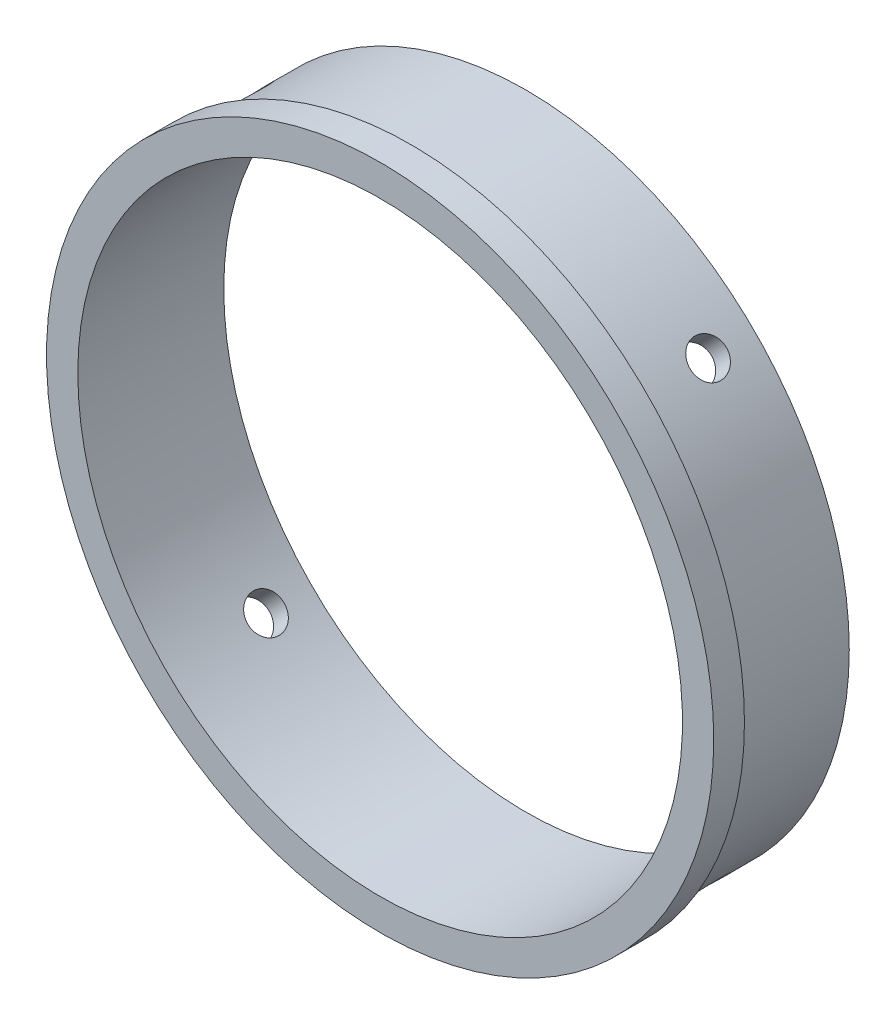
ISO-10303-21;
HEADER;
FILE_DESCRIPTION(('STEP AP214'),'2;1');
FILE_NAME('part.step','',(''),(''),'','','');
FILE_SCHEMA(('AUTOMOTIVE_DESIGN { 1 0 10303 214 1 1 1 1 }'));
ENDSEC;
DATA;
#1=APPLICATION_CONTEXT('core data for automotive mechanical design processes');
#2=APPLICATION_PROTOCOL_DEFINITION('international standard','automotive_design',2000,#1);
#3=PRODUCT_CONTEXT('',#1,'mechanical');
#4=PRODUCT('Part','Part','',(#3));
#5=PRODUCT_RELATED_PRODUCT_CATEGORY('part','',(#4));
#6=PRODUCT_DEFINITION_FORMATION('','',#4);
#7=PRODUCT_DEFINITION_CONTEXT('part definition',#1,'design');
#8=PRODUCT_DEFINITION('design','',#6,#7);
#9=PRODUCT_DEFINITION_SHAPE('','',#8);
#10=(LENGTH_UNIT() NAMED_UNIT(*) SI_UNIT(.MILLI.,.METRE.));
#11=(NAMED_UNIT(*) PLANE_ANGLE_UNIT() SI_UNIT($,.RADIAN.));
#12=(NAMED_UNIT(*) SI_UNIT($,.STERADIAN.) SOLID_ANGLE_UNIT());
#13=UNCERTAINTY_MEASURE_WITH_UNIT(LENGTH_MEASURE(1.E-05),#10,'distance_accuracy_value','');
#14=(GEOMETRIC_REPRESENTATION_CONTEXT(3) GLOBAL_UNCERTAINTY_ASSIGNED_CONTEXT((#13)) GLOBAL_UNIT_ASSIGNED_CONTEXT((#10,
#11,#12)) REPRESENTATION_CONTEXT('',''));
#15=CARTESIAN_POINT('',(0.,0.,0.));
#16=DIRECTION('',(0.,0.,1.));
#17=DIRECTION('',(1.,0.,0.));
#18=AXIS2_PLACEMENT_3D('',#15,#16,#17);
#19=CARTESIAN_POINT('',(0.,47.625,-37.35));
#20=DIRECTION('',(0.,0.,1.));
#21=DIRECTION('',(1.,0.,0.));
#22=AXIS2_PLACEMENT_3D('',#19,#20,#21);
#23=PLANE('',#22);
#24=CARTESIAN_POINT('',(0.,0.,-37.35));
#25=DIRECTION('',(0.,0.,-1.));
#26=DIRECTION('',(-1.,0.,0.));
#27=AXIS2_PLACEMENT_3D('',#24,#25,#26);
#28=CIRCLE('',#27,46.0375);
#29=CARTESIAN_POINT('',(-46.0375,0.,-37.35));
#30=VERTEX_POINT('',#29);
#31=EDGE_CURVE('E63',#30,#30,#28,.T.);
#32=ORIENTED_EDGE('',*,*,#31,.F.);
#33=EDGE_LOOP('',(#32));
#34=FACE_BOUND('',#33,.T.);
#35=CARTESIAN_POINT('',(0.,0.,-37.35));
#36=DIRECTION('',(0.,0.,1.));
#37=DIRECTION('',(1.,0.,0.));
#38=AXIS2_PLACEMENT_3D('',#35,#36,#37);
#39=CIRCLE('',#38,49.2125);
#40=CARTESIAN_POINT('',(49.2125,0.,-37.35));
#41=VERTEX_POINT('',#40);
#42=EDGE_CURVE('E47',#41,#41,#39,.T.);
#43=ORIENTED_EDGE('',*,*,#42,.F.);
#44=EDGE_LOOP('',(#43));
#45=FACE_BOUND('',#44,.T.);
#46=ADVANCED_FACE('F38',(#34,#45),#23,.F.);
#47=CARTESIAN_POINT('',(0.,0.,0.));
#48=DIRECTION('',(0.,0.,1.));
#49=DIRECTION('',(1.,0.,0.));
#50=AXIS2_PLACEMENT_3D('',#47,#48,#49);
#51=CYLINDRICAL_SURFACE('',#50,49.2125);
#52=CARTESIAN_POINT('',(36.7074316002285,-32.7785695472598,-30.2786400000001));
#53=CARTESIAN_POINT('',(36.707427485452,-32.7785751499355,-30.4345550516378));
#54=CARTESIAN_POINT('',(36.6986497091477,-32.7884122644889,-30.5905799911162));
#55=CARTESIAN_POINT('',(36.6637150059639,-32.827470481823,-30.8983237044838));
#56=CARTESIAN_POINT('',(36.6375377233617,-32.8567142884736,-31.0500372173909));
#57=CARTESIAN_POINT('',(36.5684269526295,-32.9336144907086,-31.3446556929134));
#58=CARTESIAN_POINT('',(36.5255021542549,-32.9812613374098,-31.4875651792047));
#59=CARTESIAN_POINT('',(36.4239296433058,-33.0934011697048,-31.7605674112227));
#60=CARTESIAN_POINT('',(36.3652855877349,-33.1578902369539,-31.8906631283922));
#61=CARTESIAN_POINT('',(36.233611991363,-33.3017267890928,-32.1345458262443));
#62=CARTESIAN_POINT('',(36.1605666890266,-33.3810905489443,-32.2483147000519));
#63=CARTESIAN_POINT('',(36.0019279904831,-33.5521223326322,-32.4561595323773));
#64=CARTESIAN_POINT('',(35.9163340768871,-33.6437908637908,-32.5502346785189));
#65=CARTESIAN_POINT('',(35.7347041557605,-33.8366458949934,-32.7160744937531));
#66=CARTESIAN_POINT('',(35.6386613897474,-33.9378385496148,-32.78782460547));
#67=CARTESIAN_POINT('',(35.4386857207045,-34.1466042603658,-32.9068843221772));
#68=CARTESIAN_POINT('',(35.3347528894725,-34.2541772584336,-32.9541941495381));
#69=CARTESIAN_POINT('',(35.1219128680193,-34.4723742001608,-33.0229812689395));
#70=CARTESIAN_POINT('',(35.0130111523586,-34.5829947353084,-33.04448631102));
#71=CARTESIAN_POINT('',(34.7931548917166,-34.8041784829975,-33.0611390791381));
#72=CARTESIAN_POINT('',(34.6822003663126,-34.9147416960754,-33.0562870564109));
#73=CARTESIAN_POINT('',(34.4615383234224,-35.1325567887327,-33.0203863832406));
#74=CARTESIAN_POINT('',(34.3518295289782,-35.2398122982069,-32.9893675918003));
#75=CARTESIAN_POINT('',(34.136743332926,-35.448206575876,-32.9020602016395));
#76=CARTESIAN_POINT('',(34.0313659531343,-35.5493453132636,-32.8457714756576));
#77=CARTESIAN_POINT('',(33.8280424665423,-35.7428794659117,-32.7094881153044));
#78=CARTESIAN_POINT('',(33.7301006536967,-35.8352698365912,-32.6294799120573));
#79=CARTESIAN_POINT('',(33.5447132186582,-36.008867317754,-32.4480386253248));
#80=CARTESIAN_POINT('',(33.4572676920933,-36.0900743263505,-32.3466053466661));
#81=CARTESIAN_POINT('',(33.2954893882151,-36.2393805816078,-32.1250245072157));
#82=CARTESIAN_POINT('',(33.2211750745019,-36.307461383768,-32.0048510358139));
#83=CARTESIAN_POINT('',(33.0881781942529,-36.4287077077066,-31.7492919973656));
#84=CARTESIAN_POINT('',(33.0294956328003,-36.4818732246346,-31.6139064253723));
#85=CARTESIAN_POINT('',(32.9296626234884,-36.572011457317,-31.3317501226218));
#86=CARTESIAN_POINT('',(32.8885129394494,-36.6089834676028,-31.1849788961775));
#87=CARTESIAN_POINT('',(32.8251036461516,-36.6658500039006,-30.8842249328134));
#88=CARTESIAN_POINT('',(32.802843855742,-36.6857446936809,-30.7302422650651));
#89=CARTESIAN_POINT('',(32.7779705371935,-36.707970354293,-30.4196639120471));
#90=CARTESIAN_POINT('',(32.7753299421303,-36.7103255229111,-30.2630721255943));
#91=CARTESIAN_POINT('',(32.7897113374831,-36.6974805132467,-29.9515206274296));
#92=CARTESIAN_POINT('',(32.8067332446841,-36.6822804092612,-29.7965609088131));
#93=CARTESIAN_POINT('',(32.8598570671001,-36.6346994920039,-29.4927744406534));
#94=CARTESIAN_POINT('',(32.8959465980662,-36.6023298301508,-29.3439437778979));
#95=CARTESIAN_POINT('',(32.9860119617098,-36.5211832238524,-29.0565195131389));
#96=CARTESIAN_POINT('',(33.0399879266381,-36.4724061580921,-28.9179259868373));
#97=CARTESIAN_POINT('',(33.164143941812,-36.3595480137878,-28.6547435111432));
#98=CARTESIAN_POINT('',(33.2343416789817,-36.2954502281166,-28.5301700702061));
#99=CARTESIAN_POINT('',(33.3886646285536,-36.1535363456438,-28.2987200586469));
#100=CARTESIAN_POINT('',(33.4727899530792,-36.075720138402,-28.191843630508));
#101=CARTESIAN_POINT('',(33.6524284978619,-35.9082063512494,-27.9986993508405));
#102=CARTESIAN_POINT('',(33.7479544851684,-35.8184954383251,-27.9124549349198));
#103=CARTESIAN_POINT('',(33.9473677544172,-35.6295554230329,-27.7631831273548));
#104=CARTESIAN_POINT('',(34.0512549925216,-35.5303263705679,-27.7001556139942));
#105=CARTESIAN_POINT('',(34.2641827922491,-35.3250304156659,-27.5991476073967));
#106=CARTESIAN_POINT('',(34.373220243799,-35.2189676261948,-27.5611522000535));
#107=CARTESIAN_POINT('',(34.5932802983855,-35.0028411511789,-27.511238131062));
#108=CARTESIAN_POINT('',(34.7043028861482,-34.8927774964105,-27.4993192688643));
#109=CARTESIAN_POINT('',(34.9249770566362,-34.6718974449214,-27.5018985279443));
#110=CARTESIAN_POINT('',(35.0346303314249,-34.5610823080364,-27.5163599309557));
#111=CARTESIAN_POINT('',(35.2496586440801,-34.341743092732,-27.5712131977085));
#112=CARTESIAN_POINT('',(35.3550336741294,-34.2332190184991,-27.6116051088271));
#113=CARTESIAN_POINT('',(35.5586512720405,-34.0216702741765,-27.7171648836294));
#114=CARTESIAN_POINT('',(35.6568938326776,-33.9186456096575,-27.782332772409));
#115=CARTESIAN_POINT('',(35.843668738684,-33.7212108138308,-27.9355889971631));
#116=CARTESIAN_POINT('',(35.9322013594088,-33.6268004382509,-28.0236766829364));
#117=CARTESIAN_POINT('',(36.0974166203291,-33.4493857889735,-28.220406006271));
#118=CARTESIAN_POINT('',(36.1740839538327,-33.366396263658,-28.3290737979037));
#119=CARTESIAN_POINT('',(36.3135487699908,-33.2145599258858,-28.5638508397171));
#120=CARTESIAN_POINT('',(36.3763428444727,-33.1457165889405,-28.6899643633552));
#121=CARTESIAN_POINT('',(36.4865710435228,-33.0243401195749,-28.956174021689));
#122=CARTESIAN_POINT('',(36.5339882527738,-32.9718249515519,-29.0962853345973));
#123=CARTESIAN_POINT('',(36.6121894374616,-32.8849690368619,-29.386300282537));
#124=CARTESIAN_POINT('',(36.6429929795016,-32.8506069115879,-29.5361921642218));
#125=CARTESIAN_POINT('',(36.6792031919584,-32.8101603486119,-29.7856136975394));
#126=CARTESIAN_POINT('',(36.6897772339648,-32.7983310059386,-29.8835293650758));
#127=CARTESIAN_POINT('',(36.7038927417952,-32.7825338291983,-30.0804952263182));
#128=CARTESIAN_POINT('',(36.7074342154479,-32.7785659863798,-30.1795454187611));
#129=CARTESIAN_POINT('',(36.7074316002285,-32.7785695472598,-30.2786400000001));
#130=B_SPLINE_CURVE_WITH_KNOTS('',3,(#52,#53,#54,#55,#56,#57,#58,#59,#60,#61,#62,#63,#64,#65,
#66,#67,#68,#69,#70,#71,#72,#73,#74,#75,#76,#77,#78,#79,#80,#81,#82,#83,#84,#85,#86,#87,#88,#89,
#90,#91,#92,#93,#94,#95,#96,#97,#98,#99,#100,#101,#102,#103,#104,#105,#106,#107,#108,#109,#110,
#111,#112,#113,#114,#115,#116,#117,#118,#119,#120,#121,#122,#123,#124,#125,#126,#127,#128,#129),
.UNSPECIFIED.,.T.,.F.,(4,2,2,2,2,2,2,2,2,2,2,2,2,2,2,2,2,2,2,2,2,2,2,2,2,2,2,2,2,2,2,2,2,2,2,2,
2,2,4),(0.,0.467383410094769,0.935314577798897,1.40300327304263,1.87058325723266,
2.33867785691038,2.80679176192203,3.27521027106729,3.74362451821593,4.21153458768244,
4.67944019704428,5.14681259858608,5.6141873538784,6.08182999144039,6.54947688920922,
7.01777619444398,7.48607565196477,7.95439550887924,8.42271087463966,8.89038002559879,
9.35804719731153,9.82541099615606,10.2927782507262,10.7606575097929,11.2285405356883,
11.6969525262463,12.1653620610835,12.6334922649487,13.1016188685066,13.5690943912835,
14.0365707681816,14.5040476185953,14.9715112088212,15.4395729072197,15.9077494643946,
16.3764393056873,16.8445759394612,17.1416301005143,17.4386839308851),.UNSPECIFIED.);
#131=CARTESIAN_POINT('',(36.7074316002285,-32.7785695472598,-30.2786400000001));
#132=VERTEX_POINT('',#131);
#133=EDGE_CURVE('E129',#132,#132,#130,.T.);
#134=ORIENTED_EDGE('',*,*,#133,.T.);
#135=EDGE_LOOP('',(#134));
#136=FACE_BOUND('',#135,.T.);
#137=CARTESIAN_POINT('',(-32.7785695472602,-36.7074316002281,-30.2786400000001));
#138=CARTESIAN_POINT('',(-32.7785751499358,-36.7074274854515,-30.4345550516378));
#139=CARTESIAN_POINT('',(-32.7884122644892,-36.6986497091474,-30.5905799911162));
#140=CARTESIAN_POINT('',(-32.8274704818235,-36.6637150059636,-30.8983237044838));
#141=CARTESIAN_POINT('',(-32.856714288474,-36.6375377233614,-31.0500372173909));
#142=CARTESIAN_POINT('',(-32.933614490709,-36.5684269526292,-31.3446556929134));
#143=CARTESIAN_POINT('',(-32.9812613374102,-36.5255021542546,-31.4875651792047));
#144=CARTESIAN_POINT('',(-33.0934011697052,-36.4239296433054,-31.7605674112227));
#145=CARTESIAN_POINT('',(-33.1578902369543,-36.3652855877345,-31.8906631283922));
#146=CARTESIAN_POINT('',(-33.3017267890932,-36.2336119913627,-32.1345458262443));
#147=CARTESIAN_POINT('',(-33.3810905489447,-36.1605666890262,-32.2483147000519));
#148=CARTESIAN_POINT('',(-33.5521223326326,-36.0019279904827,-32.4561595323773));
#149=CARTESIAN_POINT('',(-33.6437908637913,-35.9163340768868,-32.5502346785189));
#150=CARTESIAN_POINT('',(-33.8366458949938,-35.7347041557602,-32.7160744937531));
#151=CARTESIAN_POINT('',(-33.9378385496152,-35.6386613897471,-32.78782460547));
#152=CARTESIAN_POINT('',(-34.1466042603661,-35.4386857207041,-32.9068843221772));
#153=CARTESIAN_POINT('',(-34.2541772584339,-35.3347528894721,-32.9541941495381));
#154=CARTESIAN_POINT('',(-34.4723742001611,-35.1219128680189,-33.0229812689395));
#155=CARTESIAN_POINT('',(-34.5829947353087,-35.0130111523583,-33.04448631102));
#156=CARTESIAN_POINT('',(-34.8041784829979,-34.7931548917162,-33.0611390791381));
#157=CARTESIAN_POINT('',(-34.9147416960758,-34.6822003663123,-33.0562870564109));
#158=CARTESIAN_POINT('',(-35.1325567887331,-34.461538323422,-33.0203863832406));
#159=CARTESIAN_POINT('',(-35.2398122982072,-34.3518295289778,-32.9893675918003));
#160=CARTESIAN_POINT('',(-35.4482065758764,-34.1367433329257,-32.9020602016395));
#161=CARTESIAN_POINT('',(-35.549345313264,-34.031365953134,-32.8457714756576));
#162=CARTESIAN_POINT('',(-35.7428794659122,-33.828042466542,-32.7094881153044));
#163=CARTESIAN_POINT('',(-35.8352698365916,-33.7301006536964,-32.6294799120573));
#164=CARTESIAN_POINT('',(-36.0088673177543,-33.5447132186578,-32.4480386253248));
#165=CARTESIAN_POINT('',(-36.0900743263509,-33.4572676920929,-32.3466053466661));
#166=CARTESIAN_POINT('',(-36.2393805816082,-33.2954893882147,-32.1250245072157));
#167=CARTESIAN_POINT('',(-36.3074613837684,-33.2211750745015,-32.0048510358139));
#168=CARTESIAN_POINT('',(-36.4287077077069,-33.0881781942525,-31.7492919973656));
#169=CARTESIAN_POINT('',(-36.481873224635,-33.0294956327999,-31.6139064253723));
#170=CARTESIAN_POINT('',(-36.5720114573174,-32.929662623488,-31.3317501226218));
#171=CARTESIAN_POINT('',(-36.6089834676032,-32.8885129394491,-31.1849788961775));
#172=CARTESIAN_POINT('',(-36.6658500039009,-32.8251036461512,-30.8842249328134));
#173=CARTESIAN_POINT('',(-36.6857446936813,-32.8028438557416,-30.7302422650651));
#174=CARTESIAN_POINT('',(-36.7079703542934,-32.7779705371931,-30.4196639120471));
#175=CARTESIAN_POINT('',(-36.7103255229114,-32.7753299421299,-30.2630721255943));
#176=CARTESIAN_POINT('',(-36.6974805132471,-32.7897113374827,-29.9515206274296));
#177=CARTESIAN_POINT('',(-36.6822804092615,-32.8067332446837,-29.7965609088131));
#178=CARTESIAN_POINT('',(-36.6346994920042,-32.8598570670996,-29.4927744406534));
#179=CARTESIAN_POINT('',(-36.6023298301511,-32.8959465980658,-29.3439437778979));
#180=CARTESIAN_POINT('',(-36.5211832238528,-32.9860119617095,-29.0565195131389));
#181=CARTESIAN_POINT('',(-36.4724061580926,-33.0399879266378,-28.9179259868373));
#182=CARTESIAN_POINT('',(-36.3595480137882,-33.1641439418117,-28.6547435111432));
#183=CARTESIAN_POINT('',(-36.295450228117,-33.2343416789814,-28.5301700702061));
#184=CARTESIAN_POINT('',(-36.1535363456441,-33.3886646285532,-28.2987200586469));
#185=CARTESIAN_POINT('',(-36.0757201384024,-33.4727899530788,-28.191843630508));
#186=CARTESIAN_POINT('',(-35.9082063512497,-33.6524284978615,-27.9986993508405));
#187=CARTESIAN_POINT('',(-35.8184954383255,-33.747954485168,-27.9124549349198));
#188=CARTESIAN_POINT('',(-35.6295554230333,-33.9473677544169,-27.7631831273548));
#189=CARTESIAN_POINT('',(-35.5303263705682,-34.0512549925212,-27.7001556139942));
#190=CARTESIAN_POINT('',(-35.3250304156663,-34.2641827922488,-27.5991476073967));
#191=CARTESIAN_POINT('',(-35.2189676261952,-34.3732202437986,-27.5611522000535));
#192=CARTESIAN_POINT('',(-35.0028411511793,-34.5932802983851,-27.511238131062));
#193=CARTESIAN_POINT('',(-34.8927774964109,-34.7043028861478,-27.4993192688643));
#194=CARTESIAN_POINT('',(-34.6718974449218,-34.9249770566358,-27.5018985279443));
#195=CARTESIAN_POINT('',(-34.5610823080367,-35.0346303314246,-27.5163599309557));
#196=CARTESIAN_POINT('',(-34.3417430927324,-35.2496586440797,-27.5712131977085));
#197=CARTESIAN_POINT('',(-34.2332190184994,-35.355033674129,-27.6116051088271));
#198=CARTESIAN_POINT('',(-34.0216702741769,-35.5586512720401,-27.7171648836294));
#199=CARTESIAN_POINT('',(-33.9186456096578,-35.6568938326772,-27.782332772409));
#200=CARTESIAN_POINT('',(-33.7212108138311,-35.8436687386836,-27.9355889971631));
#201=CARTESIAN_POINT('',(-33.6268004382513,-35.9322013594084,-28.0236766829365));
#202=CARTESIAN_POINT('',(-33.4493857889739,-36.0974166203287,-28.220406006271));
#203=CARTESIAN_POINT('',(-33.3663962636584,-36.1740839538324,-28.3290737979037));
#204=CARTESIAN_POINT('',(-33.2145599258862,-36.3135487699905,-28.5638508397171));
#205=CARTESIAN_POINT('',(-33.1457165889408,-36.3763428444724,-28.6899643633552));
#206=CARTESIAN_POINT('',(-33.0243401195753,-36.4865710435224,-28.956174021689));
#207=CARTESIAN_POINT('',(-32.9718249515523,-36.5339882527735,-29.0962853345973));
#208=CARTESIAN_POINT('',(-32.8849690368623,-36.6121894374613,-29.386300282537));
#209=CARTESIAN_POINT('',(-32.8506069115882,-36.6429929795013,-29.5361921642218));
#210=CARTESIAN_POINT('',(-32.8101603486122,-36.679203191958,-29.7856136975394));
#211=CARTESIAN_POINT('',(-32.798331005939,-36.6897772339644,-29.8835293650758));
#212=CARTESIAN_POINT('',(-32.7825338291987,-36.7038927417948,-30.0804952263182));
#213=CARTESIAN_POINT('',(-32.7785659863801,-36.7074342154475,-30.1795454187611));
#214=CARTESIAN_POINT('',(-32.7785695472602,-36.7074316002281,-30.2786400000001));
#215=B_SPLINE_CURVE_WITH_KNOTS('',3,(#137,#138,#139,#140,#141,#142,#143,#144,#145,#146,#147,
#148,#149,#150,#151,#152,#153,#154,#155,#156,#157,#158,#159,#160,#161,#162,#163,#164,#165,#166,
#167,#168,#169,#170,#171,#172,#173,#174,#175,#176,#177,#178,#179,#180,#181,#182,#183,#184,#185,
#186,#187,#188,#189,#190,#191,#192,#193,#194,#195,#196,#197,#198,#199,#200,#201,#202,#203,#204,
#205,#206,#207,#208,#209,#210,#211,#212,#213,#214),.UNSPECIFIED.,.T.,.F.,(4,2,2,2,2,2,2,2,2,2,2,
2,2,2,2,2,2,2,2,2,2,2,2,2,2,2,2,2,2,2,2,2,2,2,2,2,2,2,4),(0.,0.46738341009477,0.935314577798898,
1.40300327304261,1.87058325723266,2.33867785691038,2.80679176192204,3.27521027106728,
3.74362451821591,4.21153458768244,4.67944019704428,5.14681259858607,5.6141873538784,
6.08182999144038,6.54947688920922,7.01777619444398,7.48607565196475,7.95439550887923,
8.42271087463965,8.89038002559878,9.35804719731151,9.82541099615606,10.2927782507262,
10.7606575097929,11.2285405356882,11.6969525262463,12.1653620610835,12.6334922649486,
13.1016188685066,13.5690943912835,14.0365707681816,14.5040476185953,14.9715112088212,
15.4395729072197,15.9077494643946,16.3764393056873,16.8445759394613,17.1416301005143,
17.4386839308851),.UNSPECIFIED.);
#216=CARTESIAN_POINT('',(-32.7785695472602,-36.7074316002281,-30.2786400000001));
#217=VERTEX_POINT('',#216);
#218=EDGE_CURVE('E106',#217,#217,#215,.T.);
#219=ORIENTED_EDGE('',*,*,#218,.T.);
#220=EDGE_LOOP('',(#219));
#221=FACE_BOUND('',#220,.T.);
#222=CARTESIAN_POINT('',(-36.7074316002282,32.7785695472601,-30.2786400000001));
#223=CARTESIAN_POINT('',(-36.7074274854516,32.7785751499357,-30.4345550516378));
#224=CARTESIAN_POINT('',(-36.6986497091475,32.7884122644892,-30.5905799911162));
#225=CARTESIAN_POINT('',(-36.6637150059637,32.8274704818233,-30.8983237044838));
#226=CARTESIAN_POINT('',(-36.6375377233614,32.8567142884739,-31.0500372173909));
#227=CARTESIAN_POINT('',(-36.5684269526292,32.9336144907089,-31.3446556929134));
#228=CARTESIAN_POINT('',(-36.5255021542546,32.9812613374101,-31.4875651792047));
#229=CARTESIAN_POINT('',(-36.4239296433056,33.0934011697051,-31.7605674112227));
#230=CARTESIAN_POINT('',(-36.3652855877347,33.1578902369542,-31.8906631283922));
#231=CARTESIAN_POINT('',(-36.2336119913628,33.301726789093,-32.1345458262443));
#232=CARTESIAN_POINT('',(-36.1605666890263,33.3810905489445,-32.2483147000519));
#233=CARTESIAN_POINT('',(-36.0019279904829,33.5521223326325,-32.4561595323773));
#234=CARTESIAN_POINT('',(-35.916334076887,33.6437908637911,-32.5502346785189));
#235=CARTESIAN_POINT('',(-35.7347041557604,33.8366458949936,-32.7160744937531));
#236=CARTESIAN_POINT('',(-35.6386613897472,33.937838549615,-32.78782460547));
#237=CARTESIAN_POINT('',(-35.4386857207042,34.146604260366,-32.9068843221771));
#238=CARTESIAN_POINT('',(-35.3347528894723,34.2541772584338,-32.9541941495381));
#239=CARTESIAN_POINT('',(-35.1219128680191,34.472374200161,-33.0229812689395));
#240=CARTESIAN_POINT('',(-35.0130111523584,34.5829947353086,-33.04448631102));
#241=CARTESIAN_POINT('',(-34.7931548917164,34.8041784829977,-33.0611390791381));
#242=CARTESIAN_POINT('',(-34.6822003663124,34.9147416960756,-33.0562870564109));
#243=CARTESIAN_POINT('',(-34.4615383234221,35.1325567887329,-33.0203863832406));
#244=CARTESIAN_POINT('',(-34.351829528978,35.239812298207,-32.9893675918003));
#245=CARTESIAN_POINT('',(-34.1367433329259,35.4482065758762,-32.9020602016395));
#246=CARTESIAN_POINT('',(-34.0313659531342,35.5493453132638,-32.8457714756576));
#247=CARTESIAN_POINT('',(-33.8280424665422,35.742879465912,-32.7094881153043));
#248=CARTESIAN_POINT('',(-33.7301006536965,35.8352698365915,-32.6294799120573));
#249=CARTESIAN_POINT('',(-33.5447132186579,36.0088673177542,-32.4480386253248));
#250=CARTESIAN_POINT('',(-33.4572676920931,36.0900743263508,-32.3466053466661));
#251=CARTESIAN_POINT('',(-33.2954893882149,36.2393805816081,-32.1250245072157));
#252=CARTESIAN_POINT('',(-33.2211750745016,36.3074613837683,-32.0048510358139));
#253=CARTESIAN_POINT('',(-33.0881781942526,36.4287077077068,-31.7492919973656));
#254=CARTESIAN_POINT('',(-33.0294956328,36.4818732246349,-31.6139064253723));
#255=CARTESIAN_POINT('',(-32.9296626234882,36.5720114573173,-31.3317501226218));
#256=CARTESIAN_POINT('',(-32.8885129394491,36.6089834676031,-31.1849788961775));
#257=CARTESIAN_POINT('',(-32.8251036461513,36.6658500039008,-30.8842249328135));
#258=CARTESIAN_POINT('',(-32.8028438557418,36.6857446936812,-30.7302422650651));
#259=CARTESIAN_POINT('',(-32.7779705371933,36.7079703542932,-30.4196639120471));
#260=CARTESIAN_POINT('',(-32.77532994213,36.7103255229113,-30.2630721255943));
#261=CARTESIAN_POINT('',(-32.7897113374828,36.697480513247,-29.9515206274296));
#262=CARTESIAN_POINT('',(-32.8067332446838,36.6822804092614,-29.7965609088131));
#263=CARTESIAN_POINT('',(-32.8598570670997,36.6346994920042,-29.4927744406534));
#264=CARTESIAN_POINT('',(-32.8959465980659,36.602329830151,-29.3439437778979));
#265=CARTESIAN_POINT('',(-32.9860119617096,36.5211832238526,-29.0565195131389));
#266=CARTESIAN_POINT('',(-33.039987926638,36.4724061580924,-28.9179259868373));
#267=CARTESIAN_POINT('',(-33.1641439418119,36.359548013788,-28.6547435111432));
#268=CARTESIAN_POINT('',(-33.2343416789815,36.2954502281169,-28.530170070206));
#269=CARTESIAN_POINT('',(-33.3886646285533,36.153536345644,-28.2987200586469));
#270=CARTESIAN_POINT('',(-33.472789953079,36.0757201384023,-28.191843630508));
#271=CARTESIAN_POINT('',(-33.6524284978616,35.9082063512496,-27.9986993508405));
#272=CARTESIAN_POINT('',(-33.7479544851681,35.8184954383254,-27.9124549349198));
#273=CARTESIAN_POINT('',(-33.947367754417,35.6295554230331,-27.7631831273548));
#274=CARTESIAN_POINT('',(-34.0512549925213,35.5303263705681,-27.7001556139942));
#275=CARTESIAN_POINT('',(-34.2641827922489,35.3250304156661,-27.5991476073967));
#276=CARTESIAN_POINT('',(-34.3732202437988,35.2189676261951,-27.5611522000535));
#277=CARTESIAN_POINT('',(-34.5932802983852,35.0028411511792,-27.511238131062));
#278=CARTESIAN_POINT('',(-34.7043028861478,34.8927774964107,-27.4993192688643));
#279=CARTESIAN_POINT('',(-34.9249770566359,34.6718974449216,-27.5018985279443));
#280=CARTESIAN_POINT('',(-35.0346303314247,34.5610823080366,-27.5163599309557));
#281=CARTESIAN_POINT('',(-35.2496586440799,34.3417430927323,-27.5712131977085));
#282=CARTESIAN_POINT('',(-35.3550336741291,34.2332190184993,-27.6116051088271));
#283=CARTESIAN_POINT('',(-35.5586512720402,34.0216702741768,-27.7171648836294));
#284=CARTESIAN_POINT('',(-35.6568938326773,33.9186456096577,-27.782332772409));
#285=CARTESIAN_POINT('',(-35.8436687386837,33.721210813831,-27.9355889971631));
#286=CARTESIAN_POINT('',(-35.9322013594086,33.6268004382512,-28.0236766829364));
#287=CARTESIAN_POINT('',(-36.0974166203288,33.4493857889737,-28.220406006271));
#288=CARTESIAN_POINT('',(-36.1740839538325,33.3663962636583,-28.3290737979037));
#289=CARTESIAN_POINT('',(-36.3135487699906,33.214559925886,-28.5638508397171));
#290=CARTESIAN_POINT('',(-36.3763428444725,33.1457165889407,-28.6899643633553));
#291=CARTESIAN_POINT('',(-36.4865710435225,33.0243401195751,-28.956174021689));
#292=CARTESIAN_POINT('',(-36.5339882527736,32.9718249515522,-29.0962853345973));
#293=CARTESIAN_POINT('',(-36.6121894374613,32.8849690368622,-29.386300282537));
#294=CARTESIAN_POINT('',(-36.6429929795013,32.8506069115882,-29.5361921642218));
#295=CARTESIAN_POINT('',(-36.6792031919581,32.8101603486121,-29.7856136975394));
#296=CARTESIAN_POINT('',(-36.6897772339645,32.7983310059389,-29.8835293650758));
#297=CARTESIAN_POINT('',(-36.7038927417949,32.7825338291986,-30.0804952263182));
#298=CARTESIAN_POINT('',(-36.7074342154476,32.77856598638,-30.1795454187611));
#299=CARTESIAN_POINT('',(-36.7074316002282,32.7785695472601,-30.2786400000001));
#300=B_SPLINE_CURVE_WITH_KNOTS('',3,(#222,#223,#224,#225,#226,#227,#228,#229,#230,#231,#232,
#233,#234,#235,#236,#237,#238,#239,#240,#241,#242,#243,#244,#245,#246,#247,#248,#249,#250,#251,
#252,#253,#254,#255,#256,#257,#258,#259,#260,#261,#262,#263,#264,#265,#266,#267,#268,#269,#270,
#271,#272,#273,#274,#275,#276,#277,#278,#279,#280,#281,#282,#283,#284,#285,#286,#287,#288,#289,
#290,#291,#292,#293,#294,#295,#296,#297,#298,#299),.UNSPECIFIED.,.T.,.F.,(4,2,2,2,2,2,2,2,2,2,2,
2,2,2,2,2,2,2,2,2,2,2,2,2,2,2,2,2,2,2,2,2,2,2,2,2,2,2,4),(0.,0.467383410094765,
0.935314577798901,1.40300327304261,1.87058325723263,2.33867785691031,2.80679176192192,
3.27521027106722,3.74362451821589,4.2115345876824,4.67944019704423,5.14681259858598,
5.61418735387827,6.08182999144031,6.5494768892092,7.01777619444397,7.48607565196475,
7.95439550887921,8.42271087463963,8.89038002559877,9.3580471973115,9.82541099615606,
10.2927782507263,10.7606575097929,11.2285405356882,11.6969525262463,12.1653620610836,
12.6334922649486,13.1016188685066,13.5690943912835,14.0365707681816,14.5040476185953,
14.9715112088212,15.4395729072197,15.9077494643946,16.3764393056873,16.8445759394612,
17.1416301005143,17.4386839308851),.UNSPECIFIED.);
#301=CARTESIAN_POINT('',(-36.7074316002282,32.7785695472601,-30.2786400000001));
#302=VERTEX_POINT('',#301);
#303=EDGE_CURVE('E95',#302,#302,#300,.T.);
#304=ORIENTED_EDGE('',*,*,#303,.T.);
#305=EDGE_LOOP('',(#304));
#306=FACE_BOUND('',#305,.T.);
#307=CARTESIAN_POINT('',(32.7785695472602,36.7074316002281,-30.2786400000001));
#308=CARTESIAN_POINT('',(32.7785751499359,36.7074274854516,-30.4345550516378));
#309=CARTESIAN_POINT('',(32.7884122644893,36.6986497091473,-30.5905799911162));
#310=CARTESIAN_POINT('',(32.8274704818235,36.6637150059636,-30.8983237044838));
#311=CARTESIAN_POINT('',(32.856714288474,36.6375377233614,-31.0500372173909));
#312=CARTESIAN_POINT('',(32.933614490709,36.5684269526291,-31.3446556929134));
#313=CARTESIAN_POINT('',(32.9812613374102,36.5255021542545,-31.4875651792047));
#314=CARTESIAN_POINT('',(33.0934011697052,36.4239296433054,-31.7605674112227));
#315=CARTESIAN_POINT('',(33.1578902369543,36.3652855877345,-31.8906631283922));
#316=CARTESIAN_POINT('',(33.3017267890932,36.2336119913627,-32.1345458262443));
#317=CARTESIAN_POINT('',(33.3810905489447,36.1605666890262,-32.2483147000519));
#318=CARTESIAN_POINT('',(33.5521223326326,36.0019279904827,-32.4561595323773));
#319=CARTESIAN_POINT('',(33.6437908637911,35.9163340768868,-32.5502346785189));
#320=CARTESIAN_POINT('',(33.8366458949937,35.7347041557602,-32.7160744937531));
#321=CARTESIAN_POINT('',(33.9378385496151,35.6386613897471,-32.78782460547));
#322=CARTESIAN_POINT('',(34.1466042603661,35.4386857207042,-32.9068843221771));
#323=CARTESIAN_POINT('',(34.2541772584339,35.3347528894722,-32.9541941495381));
#324=CARTESIAN_POINT('',(34.4723742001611,35.121912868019,-33.0229812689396));
#325=CARTESIAN_POINT('',(34.5829947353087,35.0130111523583,-33.04448631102));
#326=CARTESIAN_POINT('',(34.8041784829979,34.7931548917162,-33.061139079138));
#327=CARTESIAN_POINT('',(34.9147416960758,34.6822003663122,-33.0562870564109));
#328=CARTESIAN_POINT('',(35.1325567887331,34.461538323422,-33.0203863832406));
#329=CARTESIAN_POINT('',(35.2398122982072,34.3518295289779,-32.9893675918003));
#330=CARTESIAN_POINT('',(35.4482065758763,34.1367433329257,-32.9020602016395));
#331=CARTESIAN_POINT('',(35.5493453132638,34.031365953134,-32.8457714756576));
#332=CARTESIAN_POINT('',(35.742879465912,33.828042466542,-32.7094881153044));
#333=CARTESIAN_POINT('',(35.8352698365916,33.7301006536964,-32.6294799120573));
#334=CARTESIAN_POINT('',(36.0088673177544,33.5447132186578,-32.4480386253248));
#335=CARTESIAN_POINT('',(36.0900743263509,33.4572676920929,-32.3466053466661));
#336=CARTESIAN_POINT('',(36.2393805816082,33.2954893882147,-32.1250245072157));
#337=CARTESIAN_POINT('',(36.3074613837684,33.2211750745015,-32.0048510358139));
#338=CARTESIAN_POINT('',(36.4287077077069,33.0881781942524,-31.7492919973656));
#339=CARTESIAN_POINT('',(36.4818732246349,33.0294956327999,-31.6139064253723));
#340=CARTESIAN_POINT('',(36.5720114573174,32.929662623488,-31.3317501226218));
#341=CARTESIAN_POINT('',(36.6089834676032,32.888512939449,-31.1849788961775));
#342=CARTESIAN_POINT('',(36.6658500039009,32.8251036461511,-30.8842249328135));
#343=CARTESIAN_POINT('',(36.6857446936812,32.8028438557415,-30.7302422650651));
#344=CARTESIAN_POINT('',(36.7079703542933,32.7779705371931,-30.4196639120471));
#345=CARTESIAN_POINT('',(36.7103255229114,32.7753299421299,-30.2630721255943));
#346=CARTESIAN_POINT('',(36.6974805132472,32.7897113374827,-29.9515206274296));
#347=CARTESIAN_POINT('',(36.6822804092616,32.8067332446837,-29.7965609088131));
#348=CARTESIAN_POINT('',(36.6346994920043,32.8598570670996,-29.4927744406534));
#349=CARTESIAN_POINT('',(36.6023298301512,32.8959465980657,-29.3439437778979));
#350=CARTESIAN_POINT('',(36.5211832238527,32.9860119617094,-29.0565195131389));
#351=CARTESIAN_POINT('',(36.4724061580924,33.0399879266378,-28.9179259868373));
#352=CARTESIAN_POINT('',(36.359548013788,33.1641439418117,-28.6547435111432));
#353=CARTESIAN_POINT('',(36.295450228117,33.2343416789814,-28.530170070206));
#354=CARTESIAN_POINT('',(36.1535363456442,33.3886646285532,-28.2987200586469));
#355=CARTESIAN_POINT('',(36.0757201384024,33.4727899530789,-28.191843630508));
#356=CARTESIAN_POINT('',(35.9082063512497,33.6524284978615,-27.9986993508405));
#357=CARTESIAN_POINT('',(35.8184954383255,33.747954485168,-27.9124549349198));
#358=CARTESIAN_POINT('',(35.6295554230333,33.9473677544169,-27.7631831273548));
#359=CARTESIAN_POINT('',(35.5303263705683,34.0512549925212,-27.7001556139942));
#360=CARTESIAN_POINT('',(35.3250304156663,34.2641827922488,-27.5991476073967));
#361=CARTESIAN_POINT('',(35.2189676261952,34.3732202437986,-27.5611522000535));
#362=CARTESIAN_POINT('',(35.0028411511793,34.5932802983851,-27.511238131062));
#363=CARTESIAN_POINT('',(34.892777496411,34.7043028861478,-27.4993192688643));
#364=CARTESIAN_POINT('',(34.6718974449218,34.9249770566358,-27.5018985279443));
#365=CARTESIAN_POINT('',(34.5610823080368,35.0346303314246,-27.5163599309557));
#366=CARTESIAN_POINT('',(34.3417430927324,35.2496586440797,-27.5712131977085));
#367=CARTESIAN_POINT('',(34.2332190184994,35.3550336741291,-27.6116051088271));
#368=CARTESIAN_POINT('',(34.0216702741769,35.5586512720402,-27.7171648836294));
#369=CARTESIAN_POINT('',(33.9186456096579,35.6568938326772,-27.782332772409));
#370=CARTESIAN_POINT('',(33.7212108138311,35.8436687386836,-27.9355889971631));
#371=CARTESIAN_POINT('',(33.6268004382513,35.9322013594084,-28.0236766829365));
#372=CARTESIAN_POINT('',(33.4493857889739,36.0974166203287,-28.220406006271));
#373=CARTESIAN_POINT('',(33.3663962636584,36.1740839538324,-28.3290737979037));
#374=CARTESIAN_POINT('',(33.2145599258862,36.3135487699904,-28.5638508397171));
#375=CARTESIAN_POINT('',(33.1457165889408,36.3763428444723,-28.6899643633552));
#376=CARTESIAN_POINT('',(33.0243401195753,36.4865710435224,-28.956174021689));
#377=CARTESIAN_POINT('',(32.9718249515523,36.5339882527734,-29.0962853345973));
#378=CARTESIAN_POINT('',(32.8849690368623,36.6121894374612,-29.386300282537));
#379=CARTESIAN_POINT('',(32.8506069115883,36.6429929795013,-29.5361921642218));
#380=CARTESIAN_POINT('',(32.8101603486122,36.679203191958,-29.7856136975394));
#381=CARTESIAN_POINT('',(32.798331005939,36.6897772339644,-29.8835293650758));
#382=CARTESIAN_POINT('',(32.7825338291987,36.7038927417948,-30.0804952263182));
#383=CARTESIAN_POINT('',(32.7785659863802,36.7074342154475,-30.1795454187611));
#384=CARTESIAN_POINT('',(32.7785695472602,36.7074316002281,-30.2786400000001));
#385=B_SPLINE_CURVE_WITH_KNOTS('',3,(#307,#308,#309,#310,#311,#312,#313,#314,#315,#316,#317,
#318,#319,#320,#321,#322,#323,#324,#325,#326,#327,#328,#329,#330,#331,#332,#333,#334,#335,#336,
#337,#338,#339,#340,#341,#342,#343,#344,#345,#346,#347,#348,#349,#350,#351,#352,#353,#354,#355,
#356,#357,#358,#359,#360,#361,#362,#363,#364,#365,#366,#367,#368,#369,#370,#371,#372,#373,#374,
#375,#376,#377,#378,#379,#380,#381,#382,#383,#384),.UNSPECIFIED.,.T.,.F.,(4,2,2,2,2,2,2,2,2,2,2,
2,2,2,2,2,2,2,2,2,2,2,2,2,2,2,2,2,2,2,2,2,2,2,2,2,2,2,4),(0.,0.467383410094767,
0.935314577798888,1.4030032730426,1.87058325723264,2.33867785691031,2.80679176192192,
3.27521027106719,3.74362451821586,4.2115345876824,4.67944019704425,5.146812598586,
5.61418735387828,6.08182999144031,6.54947688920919,7.01777619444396,7.48607565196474,
7.95439550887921,8.42271087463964,8.89038002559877,9.3580471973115,9.82541099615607,
10.2927782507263,10.7606575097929,11.2285405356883,11.6969525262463,12.1653620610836,
12.6334922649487,13.1016188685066,13.5690943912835,14.0365707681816,14.5040476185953,
14.9715112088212,15.4395729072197,15.9077494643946,16.3764393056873,16.8445759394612,
17.1416301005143,17.4386839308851),.UNSPECIFIED.);
#386=CARTESIAN_POINT('',(32.7785695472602,36.7074316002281,-30.2786400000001));
#387=VERTEX_POINT('',#386);
#388=EDGE_CURVE('E10',#387,#387,#385,.T.);
#389=ORIENTED_EDGE('',*,*,#388,.T.);
#390=EDGE_LOOP('',(#389));
#391=FACE_BOUND('',#390,.T.);
#392=CARTESIAN_POINT('',(0.,0.,-19.80114));
#393=DIRECTION('',(0.,0.,1.));
#394=DIRECTION('',(1.,0.,0.));
#395=AXIS2_PLACEMENT_3D('',#392,#393,#394);
#396=CIRCLE('',#395,49.2125);
#397=CARTESIAN_POINT('',(49.2125,0.,-19.80114));
#398=VERTEX_POINT('',#397);
#399=EDGE_CURVE('E51',#398,#398,#396,.T.);
#400=ORIENTED_EDGE('',*,*,#399,.F.);
#401=EDGE_LOOP('',(#400));
#402=FACE_BOUND('',#401,.T.);
#403=ORIENTED_EDGE('',*,*,#42,.T.);
#404=EDGE_LOOP('',(#403));
#405=FACE_BOUND('',#404,.T.);
#406=ADVANCED_FACE('F141',(#136,#221,#306,#391,#402,#405),#51,.T.);
#407=CARTESIAN_POINT('',(0.,49.2125,-19.80114));
#408=DIRECTION('',(0.,0.,1.));
#409=DIRECTION('',(1.,0.,0.));
#410=AXIS2_PLACEMENT_3D('',#407,#408,#409);
#411=PLANE('',#410);
#412=CARTESIAN_POINT('',(0.,0.,-19.80114));
#413=DIRECTION('',(0.,0.,1.));
#414=DIRECTION('',(1.,0.,0.));
#415=AXIS2_PLACEMENT_3D('',#412,#413,#414);
#416=CIRCLE('',#415,50.8);
#417=CARTESIAN_POINT('',(50.8,0.,-19.80114));
#418=VERTEX_POINT('',#417);
#419=EDGE_CURVE('E55',#418,#418,#416,.T.);
#420=ORIENTED_EDGE('',*,*,#419,.F.);
#421=EDGE_LOOP('',(#420));
#422=FACE_BOUND('',#421,.T.);
#423=ORIENTED_EDGE('',*,*,#399,.T.);
#424=EDGE_LOOP('',(#423));
#425=FACE_BOUND('',#424,.T.);
#426=ADVANCED_FACE('F146',(#422,#425),#411,.F.);
#427=CARTESIAN_POINT('',(0.,0.,0.));
#428=DIRECTION('',(0.,0.,1.));
#429=DIRECTION('',(1.,0.,0.));
#430=AXIS2_PLACEMENT_3D('',#427,#428,#429);
#431=CYLINDRICAL_SURFACE('',#430,50.8);
#432=CARTESIAN_POINT('',(0.,0.,-15.125));
#433=DIRECTION('',(0.,0.,1.));
#434=DIRECTION('',(1.,0.,0.));
#435=AXIS2_PLACEMENT_3D('',#432,#433,#434);
#436=CIRCLE('',#435,50.8);
#437=CARTESIAN_POINT('',(50.8,0.,-15.125));
#438=VERTEX_POINT('',#437);
#439=EDGE_CURVE('E60',#438,#438,#436,.T.);
#440=ORIENTED_EDGE('',*,*,#439,.F.);
#441=EDGE_LOOP('',(#440));
#442=FACE_BOUND('',#441,.T.);
#443=ORIENTED_EDGE('',*,*,#419,.T.);
#444=EDGE_LOOP('',(#443));
#445=FACE_BOUND('',#444,.T.);
#446=ADVANCED_FACE('F157',(#442,#445),#431,.T.);
#447=CARTESIAN_POINT('',(0.,50.8,-15.125));
#448=DIRECTION('',(0.,0.,-1.));
#449=DIRECTION('',(-1.,0.,0.));
#450=AXIS2_PLACEMENT_3D('',#447,#448,#449);
#451=PLANE('',#450);
#452=ORIENTED_EDGE('',*,*,#439,.T.);
#453=EDGE_LOOP('',(#452));
#454=FACE_BOUND('',#453,.T.);
#455=CARTESIAN_POINT('',(0.,0.,-15.125));
#456=DIRECTION('',(0.,0.,-1.));
#457=DIRECTION('',(-1.,0.,0.));
#458=AXIS2_PLACEMENT_3D('',#455,#456,#457);
#459=CIRCLE('',#458,46.0375);
#460=CARTESIAN_POINT('',(-46.0375,0.,-15.125));
#461=VERTEX_POINT('',#460);
#462=EDGE_CURVE('E64',#461,#461,#459,.F.);
#463=ORIENTED_EDGE('',*,*,#462,.F.);
#464=EDGE_LOOP('',(#463));
#465=FACE_BOUND('',#464,.T.);
#466=ADVANCED_FACE('F152',(#454,#465),#451,.F.);
#467=CARTESIAN_POINT('',(0.,0.,115.088713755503));
#468=DIRECTION('',(0.,0.,-1.));
#469=DIRECTION('',(-1.,0.,0.));
#470=AXIS2_PLACEMENT_3D('',#467,#468,#469);
#471=CYLINDRICAL_SURFACE('',#470,46.0375);
#472=CARTESIAN_POINT('',(34.4585337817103,-30.5296717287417,-30.2786400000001));
#473=CARTESIAN_POINT('',(34.4585297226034,-30.529677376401,-30.1227439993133));
#474=CARTESIAN_POINT('',(34.4497907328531,-30.5395487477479,-29.9667385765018));
#475=CARTESIAN_POINT('',(34.4150076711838,-30.5787395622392,-29.6590346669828));
#476=CARTESIAN_POINT('',(34.3889434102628,-30.6080816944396,-29.5073414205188));
#477=CARTESIAN_POINT('',(34.3201216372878,-30.6852295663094,-29.2127635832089));
#478=CARTESIAN_POINT('',(34.2773728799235,-30.7330256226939,-29.0698744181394));
#479=CARTESIAN_POINT('',(34.1761970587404,-30.8454965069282,-28.7969088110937));
#480=CARTESIAN_POINT('',(34.117773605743,-30.9101674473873,-28.6668294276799));
#481=CARTESIAN_POINT('',(33.9865530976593,-31.0543894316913,-28.4229547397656));
#482=CARTESIAN_POINT('',(33.9137382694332,-31.1339588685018,-28.3091798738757));
#483=CARTESIAN_POINT('',(33.7555515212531,-31.3053944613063,-28.1013186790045));
#484=CARTESIAN_POINT('',(33.6701790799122,-31.3972611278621,-28.0072331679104));
#485=CARTESIAN_POINT('',(33.4889490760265,-31.5904926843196,-27.841359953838));
#486=CARTESIAN_POINT('',(33.3930837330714,-31.6918646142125,-27.7695889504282));
#487=CARTESIAN_POINT('',(33.1934058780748,-31.9009417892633,-27.6504890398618));
#488=CARTESIAN_POINT('',(33.0895934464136,-32.0086469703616,-27.6031598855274));
#489=CARTESIAN_POINT('',(32.8769399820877,-32.227029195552,-27.534343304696));
#490=CARTESIAN_POINT('',(32.7681052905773,-32.3377024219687,-27.5128241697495));
#491=CARTESIAN_POINT('',(32.5483082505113,-32.5589211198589,-27.496140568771));
#492=CARTESIAN_POINT('',(32.4373459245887,-32.6694665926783,-27.5009758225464));
#493=CARTESIAN_POINT('',(32.2166139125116,-32.8871585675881,-27.5368375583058));
#494=CARTESIAN_POINT('',(32.1068428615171,-32.9943093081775,-27.5678299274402));
#495=CARTESIAN_POINT('',(31.8915676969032,-33.2024358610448,-27.6550732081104));
#496=CARTESIAN_POINT('',(31.7860636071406,-33.3034116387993,-27.7113242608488));
#497=CARTESIAN_POINT('',(31.5824279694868,-33.4965876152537,-27.8475268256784));
#498=CARTESIAN_POINT('',(31.4843012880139,-33.5887820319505,-27.9274938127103));
#499=CARTESIAN_POINT('',(31.2985137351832,-33.7619697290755,-28.1088470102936));
#500=CARTESIAN_POINT('',(31.210852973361,-33.8429628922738,-28.2102334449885));
#501=CARTESIAN_POINT('',(31.0486191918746,-33.9918640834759,-28.431740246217));
#502=CARTESIAN_POINT('',(30.9740672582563,-34.0597510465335,-28.5518902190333));
#503=CARTESIAN_POINT('',(30.8406162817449,-34.1806367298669,-28.8074097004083));
#504=CARTESIAN_POINT('',(30.7817172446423,-34.2336354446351,-28.9427792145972));
#505=CARTESIAN_POINT('',(30.6814949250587,-34.3234879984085,-29.2249138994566));
#506=CARTESIAN_POINT('',(30.6401725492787,-34.360341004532,-29.3716796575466));
#507=CARTESIAN_POINT('',(30.5764809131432,-34.4170314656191,-29.6724321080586));
#508=CARTESIAN_POINT('',(30.5541114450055,-34.4368691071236,-29.8264187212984));
#509=CARTESIAN_POINT('',(30.5290956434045,-34.4590483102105,-30.1369818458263));
#510=CARTESIAN_POINT('',(30.5264182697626,-34.4614174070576,-30.2935538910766));
#511=CARTESIAN_POINT('',(30.5407945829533,-34.4486772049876,-30.6050718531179));
#512=CARTESIAN_POINT('',(30.5578481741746,-34.4335679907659,-30.760017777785));
#513=CARTESIAN_POINT('',(30.6110944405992,-34.386240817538,-31.0637681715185));
#514=CARTESIAN_POINT('',(30.6472728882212,-34.3540355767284,-31.2125771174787));
#515=CARTESIAN_POINT('',(30.7375601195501,-34.2732760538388,-31.4999675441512));
#516=CARTESIAN_POINT('',(30.7916690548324,-34.224721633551,-31.6385489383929));
#517=CARTESIAN_POINT('',(30.9161263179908,-34.11233723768,-31.9017407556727));
#518=CARTESIAN_POINT('',(30.9864948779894,-34.04848822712,-32.0263334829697));
#519=CARTESIAN_POINT('',(31.1411683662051,-33.9070787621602,-32.2578330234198));
#520=CARTESIAN_POINT('',(31.2254734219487,-33.8295181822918,-32.3647396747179));
#521=CARTESIAN_POINT('',(31.4054736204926,-33.6624820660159,-32.5579721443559));
#522=CARTESIAN_POINT('',(31.5011833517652,-33.5729912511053,-32.6442711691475));
#523=CARTESIAN_POINT('',(31.7009338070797,-33.3844430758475,-32.7936553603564));
#524=CARTESIAN_POINT('',(31.8049744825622,-33.2853857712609,-32.8567406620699));
#525=CARTESIAN_POINT('',(32.0181519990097,-33.0803746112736,-32.9578599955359));
#526=CARTESIAN_POINT('',(32.1272853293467,-32.9744254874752,-32.9959110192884));
#527=CARTESIAN_POINT('',(32.347475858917,-32.7584490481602,-33.0459372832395));
#528=CARTESIAN_POINT('',(32.4585330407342,-32.6484217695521,-33.0579127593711));
#529=CARTESIAN_POINT('',(32.6791877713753,-32.4275565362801,-33.055445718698));
#530=CARTESIAN_POINT('',(32.7887873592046,-32.3167201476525,-33.0410451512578));
#531=CARTESIAN_POINT('',(33.0036468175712,-32.097263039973,-32.9863217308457));
#532=CARTESIAN_POINT('',(33.1089066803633,-31.9886423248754,-32.9459988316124));
#533=CARTESIAN_POINT('',(33.3122447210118,-31.7768363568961,-32.8405846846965));
#534=CARTESIAN_POINT('',(33.4103229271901,-31.6736510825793,-32.775493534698));
#535=CARTESIAN_POINT('',(33.596740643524,-31.4758465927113,-32.6223966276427));
#536=CARTESIAN_POINT('',(33.685080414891,-31.3812271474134,-32.5343914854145));
#537=CARTESIAN_POINT('',(33.8499219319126,-31.2033482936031,-32.3378103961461));
#538=CARTESIAN_POINT('',(33.9264060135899,-31.1201058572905,-32.2292042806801));
#539=CARTESIAN_POINT('',(34.0655202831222,-30.967764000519,-31.9945417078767));
#540=CARTESIAN_POINT('',(34.1281470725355,-30.898668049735,-31.868480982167));
#541=CARTESIAN_POINT('',(34.2380844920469,-30.7768052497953,-31.6023520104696));
#542=CARTESIAN_POINT('',(34.2853768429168,-30.724057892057,-31.4622673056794));
#543=CARTESIAN_POINT('',(34.3633826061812,-30.6367883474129,-31.1722884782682));
#544=CARTESIAN_POINT('',(34.3941154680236,-30.6022447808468,-31.0224060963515));
#545=CARTESIAN_POINT('',(34.4302939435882,-30.5615229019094,-30.7727766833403));
#546=CARTESIAN_POINT('',(34.440872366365,-30.5495962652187,-30.6746439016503));
#547=CARTESIAN_POINT('',(34.4549935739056,-30.5336688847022,-30.4772355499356));
#548=CARTESIAN_POINT('',(34.4585363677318,-30.5296681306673,-30.3779599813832));
#549=CARTESIAN_POINT('',(34.4585337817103,-30.5296717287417,-30.2786400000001));
#550=B_SPLINE_CURVE_WITH_KNOTS('',3,(#472,#473,#474,#475,#476,#477,#478,#479,#480,#481,#482,
#483,#484,#485,#486,#487,#488,#489,#490,#491,#492,#493,#494,#495,#496,#497,#498,#499,#500,#501,
#502,#503,#504,#505,#506,#507,#508,#509,#510,#511,#512,#513,#514,#515,#516,#517,#518,#519,#520,
#521,#522,#523,#524,#525,#526,#527,#528,#529,#530,#531,#532,#533,#534,#535,#536,#537,#538,#539,
#540,#541,#542,#543,#544,#545,#546,#547,#548,#549),.UNSPECIFIED.,.T.,.F.,(4,2,2,2,2,2,2,2,2,2,2,
2,2,2,2,2,2,2,2,2,2,2,2,2,2,2,2,2,2,2,2,2,2,2,2,2,2,2,4),(0.,0.467325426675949,
0.935196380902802,1.40282216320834,1.87034031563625,2.33843949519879,2.80655811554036,
3.2750262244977,3.74348959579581,4.21137685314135,4.67925913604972,5.14653217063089,
5.61380781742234,6.08138904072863,6.54897515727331,7.01730665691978,7.4856383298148,
7.95399415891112,8.42234485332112,8.88995713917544,9.35756715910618,9.82482979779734,
10.2920963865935,10.7599475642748,11.2278030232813,11.6962635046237,12.1647212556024,
12.6328607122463,13.1009959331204,13.5683872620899,14.0357794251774,14.5031697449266,
14.9705475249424,15.4386151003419,15.9067973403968,16.375535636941,16.8437221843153,
17.1414515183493,17.4391804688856),.UNSPECIFIED.);
#551=CARTESIAN_POINT('',(34.4585337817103,-30.5296717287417,-30.2786400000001));
#552=VERTEX_POINT('',#551);
#553=EDGE_CURVE('E124',#552,#552,#550,.T.);
#554=ORIENTED_EDGE('',*,*,#553,.T.);
#555=EDGE_LOOP('',(#554));
#556=FACE_BOUND('',#555,.T.);
#557=CARTESIAN_POINT('',(-30.5296717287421,-34.45853378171,-30.2786400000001));
#558=CARTESIAN_POINT('',(-30.5296773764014,-34.4585297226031,-30.1227439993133));
#559=CARTESIAN_POINT('',(-30.5395487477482,-34.4497907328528,-29.9667385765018));
#560=CARTESIAN_POINT('',(-30.5787395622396,-34.4150076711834,-29.6590346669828));
#561=CARTESIAN_POINT('',(-30.6080816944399,-34.3889434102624,-29.5073414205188));
#562=CARTESIAN_POINT('',(-30.6852295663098,-34.3201216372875,-29.2127635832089));
#563=CARTESIAN_POINT('',(-30.7330256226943,-34.2773728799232,-29.0698744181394));
#564=CARTESIAN_POINT('',(-30.8454965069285,-34.1761970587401,-28.7969088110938));
#565=CARTESIAN_POINT('',(-30.9101674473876,-34.1177736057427,-28.6668294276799));
#566=CARTESIAN_POINT('',(-31.0543894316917,-33.9865530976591,-28.4229547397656));
#567=CARTESIAN_POINT('',(-31.1339588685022,-33.9137382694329,-28.3091798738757));
#568=CARTESIAN_POINT('',(-31.3053944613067,-33.7555515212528,-28.1013186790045));
#569=CARTESIAN_POINT('',(-31.3972611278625,-33.6701790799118,-28.0072331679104));
#570=CARTESIAN_POINT('',(-31.59049268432,-33.4889490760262,-27.841359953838));
#571=CARTESIAN_POINT('',(-31.6918646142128,-33.3930837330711,-27.7695889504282));
#572=CARTESIAN_POINT('',(-31.9009417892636,-33.1934058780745,-27.6504890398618));
#573=CARTESIAN_POINT('',(-32.0086469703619,-33.0895934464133,-27.6031598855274));
#574=CARTESIAN_POINT('',(-32.2270291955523,-32.8769399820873,-27.534343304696));
#575=CARTESIAN_POINT('',(-32.337702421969,-32.7681052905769,-27.5128241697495));
#576=CARTESIAN_POINT('',(-32.5589211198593,-32.548308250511,-27.496140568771));
#577=CARTESIAN_POINT('',(-32.6694665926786,-32.4373459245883,-27.5009758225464));
#578=CARTESIAN_POINT('',(-32.8871585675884,-32.2166139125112,-27.5368375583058));
#579=CARTESIAN_POINT('',(-32.9943093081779,-32.1068428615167,-27.5678299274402));
#580=CARTESIAN_POINT('',(-33.2024358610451,-31.8915676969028,-27.6550732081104));
#581=CARTESIAN_POINT('',(-33.3034116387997,-31.7860636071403,-27.7113242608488));
#582=CARTESIAN_POINT('',(-33.496587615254,-31.5824279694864,-27.8475268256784));
#583=CARTESIAN_POINT('',(-33.5887820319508,-31.4843012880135,-27.9274938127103));
#584=CARTESIAN_POINT('',(-33.7619697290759,-31.2985137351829,-28.1088470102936));
#585=CARTESIAN_POINT('',(-33.8429628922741,-31.2108529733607,-28.2102334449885));
#586=CARTESIAN_POINT('',(-33.9918640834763,-31.0486191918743,-28.431740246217));
#587=CARTESIAN_POINT('',(-34.0597510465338,-30.9740672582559,-28.5518902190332));
#588=CARTESIAN_POINT('',(-34.1806367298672,-30.8406162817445,-28.8074097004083));
#589=CARTESIAN_POINT('',(-34.2336354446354,-30.781717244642,-28.9427792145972));
#590=CARTESIAN_POINT('',(-34.3234879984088,-30.6814949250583,-29.2249138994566));
#591=CARTESIAN_POINT('',(-34.3603410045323,-30.6401725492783,-29.3716796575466));
#592=CARTESIAN_POINT('',(-34.4170314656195,-30.5764809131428,-29.6724321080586));
#593=CARTESIAN_POINT('',(-34.4368691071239,-30.5541114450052,-29.8264187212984));
#594=CARTESIAN_POINT('',(-34.4590483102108,-30.5290956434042,-30.1369818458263));
#595=CARTESIAN_POINT('',(-34.461417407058,-30.5264182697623,-30.2935538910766));
#596=CARTESIAN_POINT('',(-34.4486772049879,-30.540794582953,-30.6050718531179));
#597=CARTESIAN_POINT('',(-34.4335679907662,-30.5578481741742,-30.760017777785));
#598=CARTESIAN_POINT('',(-34.3862408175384,-30.6110944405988,-31.0637681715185));
#599=CARTESIAN_POINT('',(-34.3540355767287,-30.6472728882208,-31.2125771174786));
#600=CARTESIAN_POINT('',(-34.2732760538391,-30.7375601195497,-31.4999675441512));
#601=CARTESIAN_POINT('',(-34.2247216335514,-30.791669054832,-31.6385489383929));
#602=CARTESIAN_POINT('',(-34.1123372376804,-30.9161263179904,-31.9017407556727));
#603=CARTESIAN_POINT('',(-34.0484882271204,-30.986494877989,-32.0263334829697));
#604=CARTESIAN_POINT('',(-33.9070787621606,-31.1411683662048,-32.2578330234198));
#605=CARTESIAN_POINT('',(-33.8295181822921,-31.2254734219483,-32.3647396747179));
#606=CARTESIAN_POINT('',(-33.6624820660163,-31.4054736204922,-32.5579721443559));
#607=CARTESIAN_POINT('',(-33.5729912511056,-31.5011833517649,-32.6442711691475));
#608=CARTESIAN_POINT('',(-33.3844430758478,-31.7009338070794,-32.7936553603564));
#609=CARTESIAN_POINT('',(-33.2853857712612,-31.8049744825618,-32.85674066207));
#610=CARTESIAN_POINT('',(-33.0803746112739,-32.0181519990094,-32.9578599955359));
#611=CARTESIAN_POINT('',(-32.9744254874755,-32.1272853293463,-32.9959110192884));
#612=CARTESIAN_POINT('',(-32.7584490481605,-32.3474758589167,-33.0459372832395));
#613=CARTESIAN_POINT('',(-32.6484217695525,-32.4585330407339,-33.0579127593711));
#614=CARTESIAN_POINT('',(-32.4275565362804,-32.679187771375,-33.055445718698));
#615=CARTESIAN_POINT('',(-32.3167201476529,-32.7887873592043,-33.0410451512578));
#616=CARTESIAN_POINT('',(-32.0972630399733,-33.0036468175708,-32.9863217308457));
#617=CARTESIAN_POINT('',(-31.9886423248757,-33.108906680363,-32.9459988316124));
#618=CARTESIAN_POINT('',(-31.7768363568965,-33.3122447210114,-32.8405846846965));
#619=CARTESIAN_POINT('',(-31.6736510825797,-33.4103229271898,-32.775493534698));
#620=CARTESIAN_POINT('',(-31.4758465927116,-33.5967406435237,-32.6223966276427));
#621=CARTESIAN_POINT('',(-31.3812271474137,-33.6850804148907,-32.5343914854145));
#622=CARTESIAN_POINT('',(-31.2033482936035,-33.8499219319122,-32.3378103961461));
#623=CARTESIAN_POINT('',(-31.1201058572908,-33.9264060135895,-32.2292042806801));
#624=CARTESIAN_POINT('',(-30.9677640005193,-34.0655202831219,-31.9945417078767));
#625=CARTESIAN_POINT('',(-30.8986680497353,-34.1281470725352,-31.8684809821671));
#626=CARTESIAN_POINT('',(-30.7768052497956,-34.2380844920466,-31.6023520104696));
#627=CARTESIAN_POINT('',(-30.7240578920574,-34.2853768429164,-31.4622673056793));
#628=CARTESIAN_POINT('',(-30.6367883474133,-34.3633826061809,-31.1722884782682));
#629=CARTESIAN_POINT('',(-30.6022447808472,-34.3941154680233,-31.0224060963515));
#630=CARTESIAN_POINT('',(-30.5615229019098,-34.4302939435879,-30.7727766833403));
#631=CARTESIAN_POINT('',(-30.549596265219,-34.4408723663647,-30.6746439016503));
#632=CARTESIAN_POINT('',(-30.5336688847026,-34.4549935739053,-30.4772355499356));
#633=CARTESIAN_POINT('',(-30.5296681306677,-34.4585363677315,-30.3779599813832));
#634=CARTESIAN_POINT('',(-30.5296717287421,-34.45853378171,-30.2786400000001));
#635=B_SPLINE_CURVE_WITH_KNOTS('',3,(#557,#558,#559,#560,#561,#562,#563,#564,#565,#566,#567,
#568,#569,#570,#571,#572,#573,#574,#575,#576,#577,#578,#579,#580,#581,#582,#583,#584,#585,#586,
#587,#588,#589,#590,#591,#592,#593,#594,#595,#596,#597,#598,#599,#600,#601,#602,#603,#604,#605,
#606,#607,#608,#609,#610,#611,#612,#613,#614,#615,#616,#617,#618,#619,#620,#621,#622,#623,#624,
#625,#626,#627,#628,#629,#630,#631,#632,#633,#634),.UNSPECIFIED.,.T.,.F.,(4,2,2,2,2,2,2,2,2,2,2,
2,2,2,2,2,2,2,2,2,2,2,2,2,2,2,2,2,2,2,2,2,2,2,2,2,2,2,4),(0.,0.467325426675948,
0.935196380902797,1.40282216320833,1.87034031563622,2.33843949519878,2.80655811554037,
3.2750262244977,3.7434895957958,4.21137685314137,4.67925913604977,5.14653217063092,
5.61380781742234,6.08138904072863,6.5489751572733,7.01730665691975,7.48563832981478,
7.95399415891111,8.42234485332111,8.88995713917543,9.35756715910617,9.82482979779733,
10.2920963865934,10.7599475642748,11.2278030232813,11.6962635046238,12.1647212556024,
12.6328607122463,13.1009959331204,13.5683872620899,14.0357794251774,14.5031697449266,
14.9705475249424,15.4386151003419,15.9067973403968,16.375535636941,16.8437221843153,
17.1414515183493,17.4391804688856),.UNSPECIFIED.);
#636=CARTESIAN_POINT('',(-30.5296717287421,-34.45853378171,-30.2786400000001));
#637=VERTEX_POINT('',#636);
#638=EDGE_CURVE('E100',#637,#637,#635,.T.);
#639=ORIENTED_EDGE('',*,*,#638,.T.);
#640=EDGE_LOOP('',(#639));
#641=FACE_BOUND('',#640,.T.);
#642=CARTESIAN_POINT('',(-34.4585337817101,30.529671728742,-30.2786400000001));
#643=CARTESIAN_POINT('',(-34.4585297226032,30.5296773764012,-30.1227439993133));
#644=CARTESIAN_POINT('',(-34.4497907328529,30.5395487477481,-29.9667385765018));
#645=CARTESIAN_POINT('',(-34.4150076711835,30.5787395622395,-29.6590346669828));
#646=CARTESIAN_POINT('',(-34.3889434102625,30.6080816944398,-29.5073414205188));
#647=CARTESIAN_POINT('',(-34.3201216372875,30.6852295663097,-29.212763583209));
#648=CARTESIAN_POINT('',(-34.2773728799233,30.7330256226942,-29.0698744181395));
#649=CARTESIAN_POINT('',(-34.1761970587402,30.8454965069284,-28.7969088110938));
#650=CARTESIAN_POINT('',(-34.1177736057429,30.9101674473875,-28.6668294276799));
#651=CARTESIAN_POINT('',(-33.9865530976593,31.0543894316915,-28.4229547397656));
#652=CARTESIAN_POINT('',(-33.913738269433,31.133958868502,-28.3091798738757));
#653=CARTESIAN_POINT('',(-33.7555515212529,31.3053944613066,-28.1013186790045));
#654=CARTESIAN_POINT('',(-33.670179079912,31.3972611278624,-28.0072331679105));
#655=CARTESIAN_POINT('',(-33.4889490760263,31.5904926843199,-27.841359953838));
#656=CARTESIAN_POINT('',(-33.3930837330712,31.6918646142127,-27.7695889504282));
#657=CARTESIAN_POINT('',(-33.1934058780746,31.9009417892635,-27.6504890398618));
#658=CARTESIAN_POINT('',(-33.0895934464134,32.0086469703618,-27.6031598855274));
#659=CARTESIAN_POINT('',(-32.8769399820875,32.2270291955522,-27.534343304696));
#660=CARTESIAN_POINT('',(-32.768105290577,32.3377024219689,-27.5128241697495));
#661=CARTESIAN_POINT('',(-32.5483082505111,32.5589211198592,-27.496140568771));
#662=CARTESIAN_POINT('',(-32.4373459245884,32.6694665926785,-27.5009758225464));
#663=CARTESIAN_POINT('',(-32.2166139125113,32.8871585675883,-27.5368375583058));
#664=CARTESIAN_POINT('',(-32.1068428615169,32.9943093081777,-27.5678299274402));
#665=CARTESIAN_POINT('',(-31.8915676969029,33.202435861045,-27.6550732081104));
#666=CARTESIAN_POINT('',(-31.7860636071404,33.3034116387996,-27.7113242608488));
#667=CARTESIAN_POINT('',(-31.5824279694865,33.4965876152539,-27.8475268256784));
#668=CARTESIAN_POINT('',(-31.4843012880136,33.5887820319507,-27.9274938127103));
#669=CARTESIAN_POINT('',(-31.298513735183,33.7619697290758,-28.1088470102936));
#670=CARTESIAN_POINT('',(-31.2108529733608,33.8429628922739,-28.2102334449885));
#671=CARTESIAN_POINT('',(-31.0486191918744,33.9918640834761,-28.431740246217));
#672=CARTESIAN_POINT('',(-30.974067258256,34.0597510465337,-28.5518902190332));
#673=CARTESIAN_POINT('',(-30.8406162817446,34.1806367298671,-28.8074097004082));
#674=CARTESIAN_POINT('',(-30.7817172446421,34.2336354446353,-28.9427792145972));
#675=CARTESIAN_POINT('',(-30.6814949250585,34.3234879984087,-29.2249138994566));
#676=CARTESIAN_POINT('',(-30.6401725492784,34.3603410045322,-29.3716796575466));
#677=CARTESIAN_POINT('',(-30.5764809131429,34.4170314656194,-29.6724321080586));
#678=CARTESIAN_POINT('',(-30.5541114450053,34.4368691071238,-29.8264187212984));
#679=CARTESIAN_POINT('',(-30.5290956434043,34.4590483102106,-30.1369818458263));
#680=CARTESIAN_POINT('',(-30.5264182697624,34.4614174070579,-30.2935538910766));
#681=CARTESIAN_POINT('',(-30.5407945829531,34.4486772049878,-30.6050718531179));
#682=CARTESIAN_POINT('',(-30.5578481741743,34.4335679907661,-30.760017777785));
#683=CARTESIAN_POINT('',(-30.611094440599,34.3862408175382,-31.0637681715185));
#684=CARTESIAN_POINT('',(-30.6472728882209,34.3540355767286,-31.2125771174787));
#685=CARTESIAN_POINT('',(-30.7375601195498,34.273276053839,-31.4999675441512));
#686=CARTESIAN_POINT('',(-30.7916690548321,34.2247216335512,-31.6385489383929));
#687=CARTESIAN_POINT('',(-30.9161263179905,34.1123372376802,-31.9017407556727));
#688=CARTESIAN_POINT('',(-30.9864948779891,34.0484882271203,-32.0263334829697));
#689=CARTESIAN_POINT('',(-31.1411683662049,33.9070787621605,-32.2578330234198));
#690=CARTESIAN_POINT('',(-31.2254734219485,33.829518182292,-32.3647396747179));
#691=CARTESIAN_POINT('',(-31.4054736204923,33.6624820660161,-32.5579721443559));
#692=CARTESIAN_POINT('',(-31.501183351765,33.5729912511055,-32.6442711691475));
#693=CARTESIAN_POINT('',(-31.7009338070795,33.3844430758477,-32.7936553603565));
#694=CARTESIAN_POINT('',(-31.8049744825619,33.2853857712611,-32.85674066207));
#695=CARTESIAN_POINT('',(-32.0181519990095,33.0803746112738,-32.9578599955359));
#696=CARTESIAN_POINT('',(-32.1272853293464,32.9744254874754,-32.9959110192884));
#697=CARTESIAN_POINT('',(-32.3474758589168,32.7584490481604,-33.0459372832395));
#698=CARTESIAN_POINT('',(-32.458533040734,32.6484217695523,-33.0579127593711));
#699=CARTESIAN_POINT('',(-32.6791877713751,32.4275565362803,-33.0554457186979));
#700=CARTESIAN_POINT('',(-32.7887873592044,32.3167201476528,-33.0410451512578));
#701=CARTESIAN_POINT('',(-33.0036468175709,32.0972630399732,-32.9863217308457));
#702=CARTESIAN_POINT('',(-33.1089066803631,31.9886423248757,-32.9459988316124));
#703=CARTESIAN_POINT('',(-33.3122447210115,31.7768363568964,-32.8405846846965));
#704=CARTESIAN_POINT('',(-33.4103229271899,31.6736510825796,-32.775493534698));
#705=CARTESIAN_POINT('',(-33.5967406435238,31.4758465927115,-32.6223966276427));
#706=CARTESIAN_POINT('',(-33.6850804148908,31.3812271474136,-32.5343914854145));
#707=CARTESIAN_POINT('',(-33.8499219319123,31.2033482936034,-32.3378103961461));
#708=CARTESIAN_POINT('',(-33.9264060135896,31.1201058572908,-32.2292042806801));
#709=CARTESIAN_POINT('',(-34.065520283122,30.9677640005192,-31.9945417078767));
#710=CARTESIAN_POINT('',(-34.1281470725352,30.8986680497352,-31.8684809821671));
#711=CARTESIAN_POINT('',(-34.2380844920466,30.7768052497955,-31.6023520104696));
#712=CARTESIAN_POINT('',(-34.2853768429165,30.7240578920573,-31.4622673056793));
#713=CARTESIAN_POINT('',(-34.363382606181,30.6367883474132,-31.1722884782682));
#714=CARTESIAN_POINT('',(-34.3941154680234,30.602244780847,-31.0224060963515));
#715=CARTESIAN_POINT('',(-34.430293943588,30.5615229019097,-30.7727766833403));
#716=CARTESIAN_POINT('',(-34.4408723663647,30.5495962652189,-30.6746439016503));
#717=CARTESIAN_POINT('',(-34.4549935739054,30.5336688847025,-30.4772355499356));
#718=CARTESIAN_POINT('',(-34.4585363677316,30.5296681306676,-30.3779599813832));
#719=CARTESIAN_POINT('',(-34.4585337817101,30.529671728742,-30.2786400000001));
#720=B_SPLINE_CURVE_WITH_KNOTS('',3,(#642,#643,#644,#645,#646,#647,#648,#649,#650,#651,#652,
#653,#654,#655,#656,#657,#658,#659,#660,#661,#662,#663,#664,#665,#666,#667,#668,#669,#670,#671,
#672,#673,#674,#675,#676,#677,#678,#679,#680,#681,#682,#683,#684,#685,#686,#687,#688,#689,#690,
#691,#692,#693,#694,#695,#696,#697,#698,#699,#700,#701,#702,#703,#704,#705,#706,#707,#708,#709,
#710,#711,#712,#713,#714,#715,#716,#717,#718,#719),.UNSPECIFIED.,.T.,.F.,(4,2,2,2,2,2,2,2,2,2,2,
2,2,2,2,2,2,2,2,2,2,2,2,2,2,2,2,2,2,2,2,2,2,2,2,2,2,2,4),(0.,0.467325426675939,
0.935196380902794,1.4028221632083,1.87034031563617,2.33843949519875,2.8065581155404,
3.27502622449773,3.74348959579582,4.21137685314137,4.67925913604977,5.14653217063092,
5.61380781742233,6.08138904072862,6.54897515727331,7.01730665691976,7.48563832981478,
7.95399415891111,8.42234485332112,8.88995713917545,9.35756715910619,9.82482979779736,
10.2920963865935,10.7599475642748,11.2278030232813,11.6962635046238,12.1647212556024,
12.6328607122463,13.1009959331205,13.5683872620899,14.0357794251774,14.5031697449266,
14.9705475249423,15.4386151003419,15.9067973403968,16.375535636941,16.8437221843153,
17.1414515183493,17.4391804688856),.UNSPECIFIED.);
#721=CARTESIAN_POINT('',(-34.4585337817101,30.529671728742,-30.2786400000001));
#722=VERTEX_POINT('',#721);
#723=EDGE_CURVE('E75',#722,#722,#720,.T.);
#724=ORIENTED_EDGE('',*,*,#723,.T.);
#725=EDGE_LOOP('',(#724));
#726=FACE_BOUND('',#725,.T.);
#727=CARTESIAN_POINT('',(30.5296717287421,34.45853378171,-30.2786400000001));
#728=CARTESIAN_POINT('',(30.5296773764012,34.4585297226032,-30.1227439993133));
#729=CARTESIAN_POINT('',(30.5395487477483,34.4497907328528,-29.9667385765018));
#730=CARTESIAN_POINT('',(30.5787395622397,34.4150076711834,-29.6590346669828));
#731=CARTESIAN_POINT('',(30.60808169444,34.3889434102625,-29.5073414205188));
#732=CARTESIAN_POINT('',(30.6852295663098,34.3201216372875,-29.2127635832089));
#733=CARTESIAN_POINT('',(30.7330256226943,34.2773728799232,-29.0698744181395));
#734=CARTESIAN_POINT('',(30.8454965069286,34.1761970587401,-28.7969088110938));
#735=CARTESIAN_POINT('',(30.9101674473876,34.1177736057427,-28.6668294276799));
#736=CARTESIAN_POINT('',(31.0543894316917,33.9865530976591,-28.4229547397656));
#737=CARTESIAN_POINT('',(31.1339588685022,33.9137382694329,-28.3091798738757));
#738=CARTESIAN_POINT('',(31.3053944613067,33.7555515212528,-28.1013186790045));
#739=CARTESIAN_POINT('',(31.3972611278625,33.6701790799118,-28.0072331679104));
#740=CARTESIAN_POINT('',(31.59049268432,33.4889490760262,-27.841359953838));
#741=CARTESIAN_POINT('',(31.6918646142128,33.3930837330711,-27.7695889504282));
#742=CARTESIAN_POINT('',(31.9009417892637,33.1934058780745,-27.6504890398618));
#743=CARTESIAN_POINT('',(32.0086469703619,33.0895934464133,-27.6031598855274));
#744=CARTESIAN_POINT('',(32.2270291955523,32.8769399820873,-27.534343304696));
#745=CARTESIAN_POINT('',(32.337702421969,32.7681052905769,-27.5128241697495));
#746=CARTESIAN_POINT('',(32.5589211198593,32.548308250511,-27.496140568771));
#747=CARTESIAN_POINT('',(32.6694665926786,32.4373459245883,-27.5009758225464));
#748=CARTESIAN_POINT('',(32.8871585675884,32.2166139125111,-27.5368375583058));
#749=CARTESIAN_POINT('',(32.9943093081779,32.1068428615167,-27.5678299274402));
#750=CARTESIAN_POINT('',(33.2024358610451,31.8915676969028,-27.6550732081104));
#751=CARTESIAN_POINT('',(33.3034116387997,31.7860636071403,-27.7113242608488));
#752=CARTESIAN_POINT('',(33.496587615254,31.5824279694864,-27.8475268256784));
#753=CARTESIAN_POINT('',(33.5887820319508,31.4843012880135,-27.9274938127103));
#754=CARTESIAN_POINT('',(33.7619697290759,31.2985137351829,-28.1088470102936));
#755=CARTESIAN_POINT('',(33.8429628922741,31.2108529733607,-28.2102334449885));
#756=CARTESIAN_POINT('',(33.9918640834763,31.0486191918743,-28.4317402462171));
#757=CARTESIAN_POINT('',(34.0597510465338,30.9740672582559,-28.5518902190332));
#758=CARTESIAN_POINT('',(34.1806367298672,30.8406162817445,-28.8074097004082));
#759=CARTESIAN_POINT('',(34.2336354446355,30.781717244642,-28.9427792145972));
#760=CARTESIAN_POINT('',(34.3234879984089,30.6814949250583,-29.2249138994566));
#761=CARTESIAN_POINT('',(34.3603410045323,30.6401725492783,-29.3716796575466));
#762=CARTESIAN_POINT('',(34.4170314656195,30.5764809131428,-29.6724321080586));
#763=CARTESIAN_POINT('',(34.4368691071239,30.5541114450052,-29.8264187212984));
#764=CARTESIAN_POINT('',(34.4590483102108,30.5290956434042,-30.1369818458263));
#765=CARTESIAN_POINT('',(34.461417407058,30.5264182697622,-30.2935538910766));
#766=CARTESIAN_POINT('',(34.448677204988,30.5407945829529,-30.6050718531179));
#767=CARTESIAN_POINT('',(34.4335679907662,30.5578481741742,-30.760017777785));
#768=CARTESIAN_POINT('',(34.3862408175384,30.6110944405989,-31.0637681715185));
#769=CARTESIAN_POINT('',(34.3540355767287,30.6472728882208,-31.2125771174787));
#770=CARTESIAN_POINT('',(34.2732760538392,30.7375601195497,-31.4999675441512));
#771=CARTESIAN_POINT('',(34.2247216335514,30.791669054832,-31.6385489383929));
#772=CARTESIAN_POINT('',(34.1123372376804,30.9161263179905,-31.9017407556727));
#773=CARTESIAN_POINT('',(34.0484882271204,30.986494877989,-32.0263334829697));
#774=CARTESIAN_POINT('',(33.9070787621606,31.1411683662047,-32.2578330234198));
#775=CARTESIAN_POINT('',(33.8295181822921,31.2254734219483,-32.3647396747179));
#776=CARTESIAN_POINT('',(33.6624820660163,31.4054736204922,-32.5579721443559));
#777=CARTESIAN_POINT('',(33.5729912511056,31.5011833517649,-32.6442711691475));
#778=CARTESIAN_POINT('',(33.3844430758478,31.7009338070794,-32.7936553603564));
#779=CARTESIAN_POINT('',(33.2853857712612,31.8049744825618,-32.8567406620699));
#780=CARTESIAN_POINT('',(33.0803746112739,32.0181519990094,-32.9578599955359));
#781=CARTESIAN_POINT('',(32.9744254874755,32.1272853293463,-32.9959110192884));
#782=CARTESIAN_POINT('',(32.7584490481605,32.3474758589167,-33.0459372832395));
#783=CARTESIAN_POINT('',(32.6484217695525,32.4585330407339,-33.0579127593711));
#784=CARTESIAN_POINT('',(32.4275565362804,32.679187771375,-33.0554457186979));
#785=CARTESIAN_POINT('',(32.3167201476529,32.7887873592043,-33.0410451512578));
#786=CARTESIAN_POINT('',(32.0972630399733,33.0036468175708,-32.9863217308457));
#787=CARTESIAN_POINT('',(31.9886423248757,33.108906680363,-32.9459988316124));
#788=CARTESIAN_POINT('',(31.7768363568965,33.3122447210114,-32.8405846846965));
#789=CARTESIAN_POINT('',(31.6736510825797,33.4103229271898,-32.775493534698));
#790=CARTESIAN_POINT('',(31.4758465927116,33.5967406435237,-32.6223966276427));
#791=CARTESIAN_POINT('',(31.3812271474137,33.6850804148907,-32.5343914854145));
#792=CARTESIAN_POINT('',(31.2033482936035,33.8499219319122,-32.3378103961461));
#793=CARTESIAN_POINT('',(31.1201058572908,33.9264060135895,-32.2292042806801));
#794=CARTESIAN_POINT('',(30.9677640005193,34.0655202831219,-31.9945417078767));
#795=CARTESIAN_POINT('',(30.8986680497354,34.1281470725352,-31.8684809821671));
#796=CARTESIAN_POINT('',(30.7768052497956,34.2380844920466,-31.6023520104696));
#797=CARTESIAN_POINT('',(30.7240578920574,34.2853768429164,-31.4622673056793));
#798=CARTESIAN_POINT('',(30.6367883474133,34.3633826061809,-31.1722884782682));
#799=CARTESIAN_POINT('',(30.6022447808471,34.3941154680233,-31.0224060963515));
#800=CARTESIAN_POINT('',(30.5615229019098,34.4302939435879,-30.7727766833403));
#801=CARTESIAN_POINT('',(30.5495962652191,34.4408723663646,-30.6746439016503));
#802=CARTESIAN_POINT('',(30.5336688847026,34.4549935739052,-30.4772355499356));
#803=CARTESIAN_POINT('',(30.5296681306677,34.4585363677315,-30.3779599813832));
#804=CARTESIAN_POINT('',(30.5296717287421,34.45853378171,-30.2786400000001));
#805=B_SPLINE_CURVE_WITH_KNOTS('',3,(#727,#728,#729,#730,#731,#732,#733,#734,#735,#736,#737,
#738,#739,#740,#741,#742,#743,#744,#745,#746,#747,#748,#749,#750,#751,#752,#753,#754,#755,#756,
#757,#758,#759,#760,#761,#762,#763,#764,#765,#766,#767,#768,#769,#770,#771,#772,#773,#774,#775,
#776,#777,#778,#779,#780,#781,#782,#783,#784,#785,#786,#787,#788,#789,#790,#791,#792,#793,#794,
#795,#796,#797,#798,#799,#800,#801,#802,#803,#804),.UNSPECIFIED.,.T.,.F.,(4,2,2,2,2,2,2,2,2,2,2,
2,2,2,2,2,2,2,2,2,2,2,2,2,2,2,2,2,2,2,2,2,2,2,2,2,2,2,4),(0.,0.467325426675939,
0.935196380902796,1.40282216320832,1.87034031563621,2.33843949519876,2.80655811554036,
3.27502622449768,3.74348959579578,4.21137685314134,4.67925913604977,5.14653217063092,
5.61380781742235,6.08138904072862,6.54897515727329,7.01730665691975,7.48563832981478,
7.95399415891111,8.42234485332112,8.88995713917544,9.35756715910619,9.82482979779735,
10.2920963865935,10.7599475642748,11.2278030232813,11.6962635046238,12.1647212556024,
12.6328607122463,13.1009959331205,13.5683872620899,14.0357794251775,14.5031697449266,
14.9705475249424,15.4386151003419,15.9067973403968,16.375535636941,16.8437221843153,
17.1414515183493,17.4391804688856),.UNSPECIFIED.);
#806=CARTESIAN_POINT('',(30.5296717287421,34.45853378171,-30.2786400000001));
#807=VERTEX_POINT('',#806);
#808=EDGE_CURVE('E67',#807,#807,#805,.T.);
#809=ORIENTED_EDGE('',*,*,#808,.T.);
#810=EDGE_LOOP('',(#809));
#811=FACE_BOUND('',#810,.T.);
#812=ORIENTED_EDGE('',*,*,#462,.T.);
#813=EDGE_LOOP('',(#812));
#814=FACE_BOUND('',#813,.T.);
#815=ORIENTED_EDGE('',*,*,#31,.T.);
#816=EDGE_LOOP('',(#815));
#817=FACE_BOUND('',#816,.T.);
#818=ADVANCED_FACE('F81',(#556,#641,#726,#811,#814,#817),#471,.F.);
#819=CARTESIAN_POINT('',(34.798492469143,34.798492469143,-30.2786400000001));
#820=DIRECTION('',(0.707106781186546,0.707106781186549,0.));
#821=DIRECTION('',(-0.707106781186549,0.707106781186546,0.));
#822=AXIS2_PLACEMENT_3D('',#819,#820,#821);
#823=CYLINDRICAL_SURFACE('',#822,2.778125);
#824=ORIENTED_EDGE('',*,*,#388,.F.);
#825=EDGE_LOOP('',(#824));
#826=FACE_BOUND('',#825,.T.);
#827=ORIENTED_EDGE('',*,*,#808,.F.);
#828=EDGE_LOOP('',(#827));
#829=FACE_BOUND('',#828,.T.);
#830=ADVANCED_FACE('F84',(#826,#829),#823,.F.);
#831=CARTESIAN_POINT('',(-34.7984924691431,34.7984924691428,-30.2786400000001));
#832=DIRECTION('',(-0.707106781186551,0.707106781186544,0.));
#833=DIRECTION('',(-0.707106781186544,-0.707106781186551,0.));
#834=AXIS2_PLACEMENT_3D('',#831,#832,#833);
#835=CYLINDRICAL_SURFACE('',#834,2.778125);
#836=ORIENTED_EDGE('',*,*,#303,.F.);
#837=EDGE_LOOP('',(#836));
#838=FACE_BOUND('',#837,.T.);
#839=ORIENTED_EDGE('',*,*,#723,.F.);
#840=EDGE_LOOP('',(#839));
#841=FACE_BOUND('',#840,.T.);
#842=ADVANCED_FACE('F87',(#838,#841),#835,.F.);
#843=CARTESIAN_POINT('',(-34.7984924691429,-34.798492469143,-30.2786400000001));
#844=DIRECTION('',(-0.707106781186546,-0.707106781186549,0.));
#845=DIRECTION('',(0.707106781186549,-0.707106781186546,0.));
#846=AXIS2_PLACEMENT_3D('',#843,#844,#845);
#847=CYLINDRICAL_SURFACE('',#846,2.778125);
#848=ORIENTED_EDGE('',*,*,#218,.F.);
#849=EDGE_LOOP('',(#848));
#850=FACE_BOUND('',#849,.T.);
#851=ORIENTED_EDGE('',*,*,#638,.F.);
#852=EDGE_LOOP('',(#851));
#853=FACE_BOUND('',#852,.T.);
#854=ADVANCED_FACE('F112',(#850,#853),#847,.F.);
#855=CARTESIAN_POINT('',(34.7984924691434,-34.7984924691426,-30.2786400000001));
#856=DIRECTION('',(0.707106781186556,-0.707106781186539,0.));
#857=DIRECTION('',(0.707106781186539,0.707106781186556,0.));
#858=AXIS2_PLACEMENT_3D('',#855,#856,#857);
#859=CYLINDRICAL_SURFACE('',#858,2.778125);
#860=ORIENTED_EDGE('',*,*,#133,.F.);
#861=EDGE_LOOP('',(#860));
#862=FACE_BOUND('',#861,.T.);
#863=ORIENTED_EDGE('',*,*,#553,.F.);
#864=EDGE_LOOP('',(#863));
#865=FACE_BOUND('',#864,.T.);
#866=ADVANCED_FACE('F116',(#862,#865),#859,.F.);
#867=CLOSED_SHELL('',(#46,#406,#426,#446,#466,#818,#830,#842,#854,#866));
#868=MANIFOLD_SOLID_BREP('B2',#867);
#869=ADVANCED_BREP_SHAPE_REPRESENTATION('',(#18,#868),#14);
#870=SHAPE_DEFINITION_REPRESENTATION(#9,#869);
ENDSEC;
END-ISO-10303-21;
